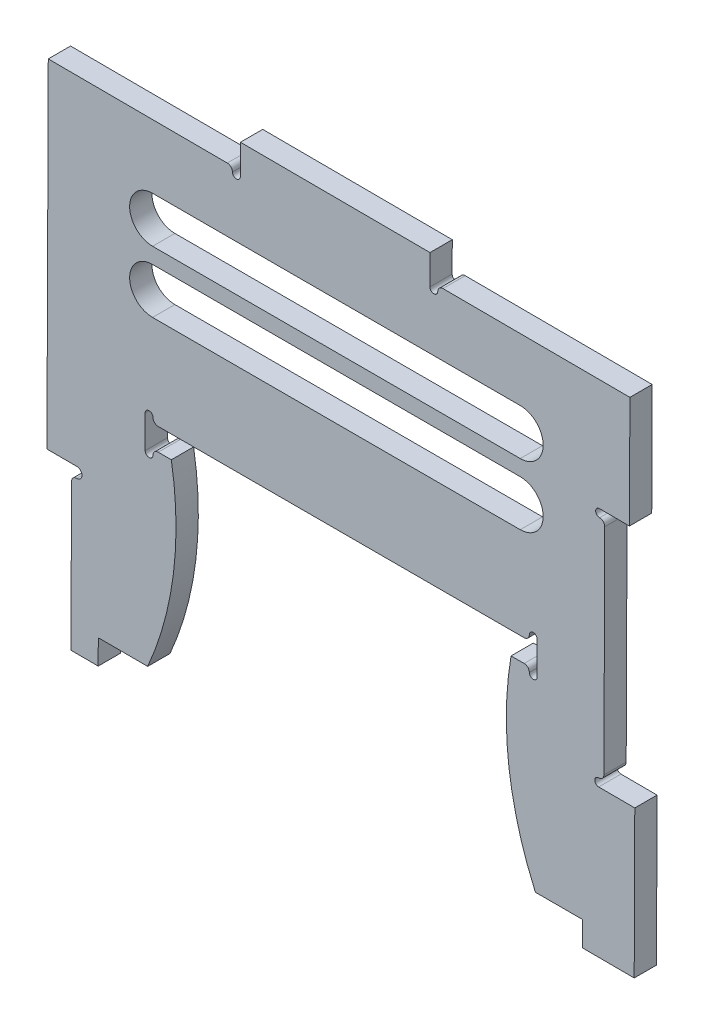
from build123d import *

# Parameters (mm, degrees)
BOSS_EXTRUDE1_DEPTH = 17


with BuildPart() as part:
    # Sketch2 → Boss-Extrude1 (new body)
    with BuildSketch(Plane.XY):
        with BuildLine():
            Line((92.222180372, 176.104683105), (82.222180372, 176.104683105))
            ThreePointArc((82.222180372, 176.104683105), (79.424121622, 174.945689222), (78.26512774, 172.147630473))
            ThreePointArc((78.26512774, 172.147630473), (75.26512774, 169.147630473), (72.26512774, 172.147630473))
            Line((72.26512774, 172.147630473), (72.26512774, 197.057735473))
            ThreePointArc((72.26512774, 197.057735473), (75.26512774, 200.057735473), (78.26512774, 197.057735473))
            ThreePointArc((78.26512774, 197.057735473), (79.424121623, 194.259676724), (82.222180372, 193.100682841))
            Line((82.222180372, 193.100682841), (361.293317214, 193.100682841))
            ThreePointArc((361.293317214, 193.100682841), (364.091375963, 194.259676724), (365.250369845, 197.057735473))
            ThreePointArc((365.250369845, 197.057735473), (368.250369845, 200.057735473), (371.250369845, 197.057735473))
            Line((371.250369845, 197.057735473), (371.250369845, 172.147630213))
            ThreePointArc((371.250369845, 172.147630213), (368.250369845, 169.147630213), (365.250369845, 172.147630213))
            ThreePointArc((365.250369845, 172.147630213), (364.091375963, 174.945688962), (361.293317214, 176.104682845))
            Line((361.293317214, 176.104682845), (351.293317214, 176.104683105))
            ThreePointArc((351.293317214, 176.104683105), (349.644494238, 102.022376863), (369.339745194, 30.587064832))
            ThreePointArc((369.339745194, 30.587064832), (369.574539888, 29.802567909), (370.210124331, 29.286238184))
            Line((370.210124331, 29.286238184), (395.68512872, 29.286238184))
            Line((395.68512872, 29.286238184), (405.642181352, 29.286238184))
            Line((405.642181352, 29.286238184), (405.642181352, 10.490238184))
            Line((405.642181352, 10.490238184), (445.212403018, 10.334963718))
            Line((445.212403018, 10.334963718), (445.653981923, 122.867150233))
            Line((445.653981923, 122.867150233), (418.115878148, 122.97521039))
            ThreePointArc((418.115878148, 122.97521039), (415.127673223, 125.986959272), (418.139422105, 128.975164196))
            ThreePointArc((418.139422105, 128.975164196), (420.942007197, 130.123169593), (422.111971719, 132.916658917))
            Line((422.111971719, 132.916658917), (422.756360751, 297.133078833))
            ThreePointArc((422.756360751, 297.133078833), (421.608355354, 299.935663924), (418.814866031, 301.105628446))
            ThreePointArc((418.814866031, 301.105628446), (415.826661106, 304.117377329), (418.838409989, 307.105582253))
            Line((418.838409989, 307.105582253), (441.591287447, 307.016299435))
            Line((441.591287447, 307.016299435), (441.925516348, 392.191357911))
            Line((441.925516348, 392.191357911), (299.365259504, 392.750767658))
            ThreePointArc((299.365259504, 392.750767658), (296.562674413, 391.602762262), (295.392709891, 388.809272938))
            ThreePointArc((295.392709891, 388.809272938), (292.380961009, 385.821068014), (289.392756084, 388.832816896))
            Line((289.392756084, 388.832816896), (289.482038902, 411.585694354))
            Line((289.482038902, 411.585694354), (144.922038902, 412.1679736))
            Line((144.922038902, 412.1679736), (144.832756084, 389.415096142))
            ThreePointArc((144.832756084, 389.415096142), (141.821007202, 386.426891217), (138.832802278, 389.4386401))
            ThreePointArc((138.832802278, 389.4386401), (137.684796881, 392.241225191), (134.891307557, 393.411189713))
            Line((134.891307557, 393.411189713), (-1.625957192, 393.946886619))
            Line((-1.625957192, 393.946886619), (-2.639123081, 135.751190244))
            Line((-2.639123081, 135.751190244), (20.113754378, 135.661907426))
            ThreePointArc((20.113754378, 135.661907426), (24.055249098, 131.689357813), (20.082699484, 127.747863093))
            ThreePointArc((20.082699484, 127.747863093), (17.280114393, 126.599857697), (16.110149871, 123.806368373))
            Line((16.110149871, 123.806368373), (15.671499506, 12.020492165))
            Line((15.671499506, 12.020492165), (36.445865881, 11.93897307))
            Line((36.445865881, 11.93897307), (36.519621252, 30.734828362))
            Line((36.519621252, 30.734828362), (46.476597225, 30.695756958))
            Line((46.476597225, 30.695756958), (74.175752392, 30.587064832))
            ThreePointArc((74.175752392, 30.587064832), (93.871003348, 102.022376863), (92.222180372, 176.104683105))
        make_face()
        with BuildLine():
            Line((77.929325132, 344.95785369), (358.300339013, 344.95785369))
            ThreePointArc((358.300339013, 344.95785369), (375.800339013, 327.45785369), (358.300339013, 309.95785369))
            Line((358.300339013, 309.95785369), (77.929325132, 309.95785369))
            ThreePointArc((77.929325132, 309.95785369), (60.429325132, 327.45785369), (77.929325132, 344.95785369))
        make_face(mode=Mode.SUBTRACT)
        with BuildLine():
            Line((77.929325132, 262.95785369), (358.300339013, 262.95785369))
            ThreePointArc((358.300339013, 262.95785369), (375.800339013, 280.45785369), (358.300339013, 297.95785369))
            Line((358.300339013, 297.95785369), (77.929325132, 297.95785369))
            ThreePointArc((77.929325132, 297.95785369), (60.429325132, 280.45785369), (77.929325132, 262.95785369))
        make_face(mode=Mode.SUBTRACT)
    extrude(amount=BOSS_EXTRUDE1_DEPTH)


solid = part.part
